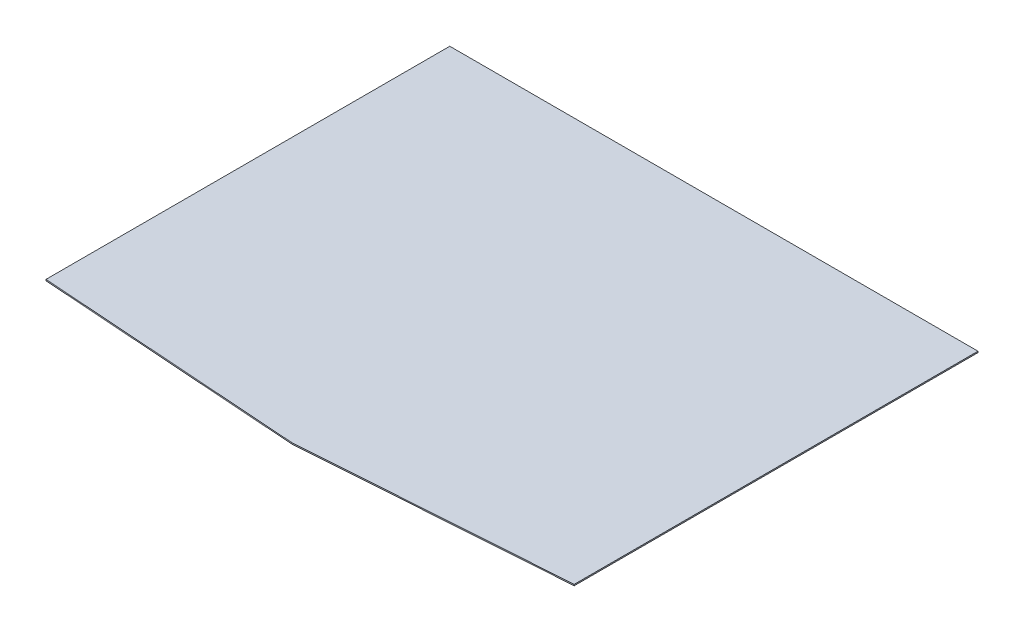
ISO-10303-21;
HEADER;
FILE_DESCRIPTION(('STEP AP214'),'2;1');
FILE_NAME('part.step','',(''),(''),'','','');
FILE_SCHEMA(('AUTOMOTIVE_DESIGN { 1 0 10303 214 1 1 1 1 }'));
ENDSEC;
DATA;
#1=APPLICATION_CONTEXT('core data for automotive mechanical design processes');
#2=APPLICATION_PROTOCOL_DEFINITION('international standard','automotive_design',2000,#1);
#3=PRODUCT_CONTEXT('',#1,'mechanical');
#4=PRODUCT('Part','Part','',(#3));
#5=PRODUCT_RELATED_PRODUCT_CATEGORY('part','',(#4));
#6=PRODUCT_DEFINITION_FORMATION('','',#4);
#7=PRODUCT_DEFINITION_CONTEXT('part definition',#1,'design');
#8=PRODUCT_DEFINITION('design','',#6,#7);
#9=PRODUCT_DEFINITION_SHAPE('','',#8);
#10=(LENGTH_UNIT() NAMED_UNIT(*) SI_UNIT(.MILLI.,.METRE.));
#11=(NAMED_UNIT(*) PLANE_ANGLE_UNIT() SI_UNIT($,.RADIAN.));
#12=(NAMED_UNIT(*) SI_UNIT($,.STERADIAN.) SOLID_ANGLE_UNIT());
#13=UNCERTAINTY_MEASURE_WITH_UNIT(LENGTH_MEASURE(1.E-05),#10,'distance_accuracy_value','');
#14=(GEOMETRIC_REPRESENTATION_CONTEXT(3) GLOBAL_UNCERTAINTY_ASSIGNED_CONTEXT((#13)) GLOBAL_UNIT_ASSIGNED_CONTEXT((#10,
#11,#12)) REPRESENTATION_CONTEXT('',''));
#15=CARTESIAN_POINT('',(0.,0.,0.));
#16=DIRECTION('',(0.,0.,1.));
#17=DIRECTION('',(1.,0.,0.));
#18=AXIS2_PLACEMENT_3D('',#15,#16,#17);
#19=CARTESIAN_POINT('',(-996.95,-4.7625,-69.7135351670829));
#20=DIRECTION('',(-0.0697564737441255,0.,0.997564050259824));
#21=DIRECTION('',(0.997564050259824,0.,0.0697564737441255));
#22=AXIS2_PLACEMENT_3D('',#19,#20,#21);
#23=PLANE('',#22);
#24=DIRECTION('',(0.997564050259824,0.,0.0697564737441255));
#25=VECTOR('',#24,1.);
#26=CARTESIAN_POINT('',(-996.95,0.,-69.7135351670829));
#27=LINE('',#26,#25);
#28=CARTESIAN_POINT('',(-996.95,0.,-69.7135351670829));
#29=VERTEX_POINT('',#28);
#30=CARTESIAN_POINT('',(0.,0.,0.));
#31=VERTEX_POINT('',#30);
#32=EDGE_CURVE('E114',#29,#31,#27,.T.);
#33=ORIENTED_EDGE('',*,*,#32,.F.);
#34=DIRECTION('',(0.,1.,0.));
#35=VECTOR('',#34,1.);
#36=CARTESIAN_POINT('',(-996.95,-4.7625,-69.7135351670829));
#37=LINE('',#36,#35);
#38=CARTESIAN_POINT('',(-996.95,-4.7625,-69.7135351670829));
#39=VERTEX_POINT('',#38);
#40=EDGE_CURVE('E11',#39,#29,#37,.T.);
#41=ORIENTED_EDGE('',*,*,#40,.F.);
#42=DIRECTION('',(0.997564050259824,0.,0.0697564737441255));
#43=VECTOR('',#42,1.);
#44=CARTESIAN_POINT('',(-996.95,-4.7625,-69.7135351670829));
#45=LINE('',#44,#43);
#46=CARTESIAN_POINT('',(0.,-4.7625,0.));
#47=VERTEX_POINT('',#46);
#48=EDGE_CURVE('E109',#39,#47,#45,.T.);
#49=ORIENTED_EDGE('',*,*,#48,.T.);
#50=DIRECTION('',(0.,1.,0.));
#51=VECTOR('',#50,1.);
#52=CARTESIAN_POINT('',(0.,-4.7625,0.));
#53=LINE('',#52,#51);
#54=EDGE_CURVE('E40',#47,#31,#53,.T.);
#55=ORIENTED_EDGE('',*,*,#54,.T.);
#56=EDGE_LOOP('',(#33,#41,#49,#55));
#57=FACE_BOUND('',#56,.T.);
#58=ADVANCED_FACE('F37',(#57),#23,.T.);
#59=CARTESIAN_POINT('',(-996.95,-4.7625,-1593.85));
#60=DIRECTION('',(-1.,0.,0.));
#61=DIRECTION('',(0.,0.,1.));
#62=AXIS2_PLACEMENT_3D('',#59,#60,#61);
#63=PLANE('',#62);
#64=DIRECTION('',(0.,0.,1.));
#65=VECTOR('',#64,1.);
#66=CARTESIAN_POINT('',(-996.95,0.,-1593.85));
#67=LINE('',#66,#65);
#68=CARTESIAN_POINT('',(-996.95,0.,-1593.85));
#69=VERTEX_POINT('',#68);
#70=EDGE_CURVE('E123',#69,#29,#67,.T.);
#71=ORIENTED_EDGE('',*,*,#70,.F.);
#72=DIRECTION('',(0.,1.,0.));
#73=VECTOR('',#72,1.);
#74=CARTESIAN_POINT('',(-996.95,-4.7625,-1593.85));
#75=LINE('',#74,#73);
#76=CARTESIAN_POINT('',(-996.95,-4.7625,-1593.85));
#77=VERTEX_POINT('',#76);
#78=EDGE_CURVE('E46',#77,#69,#75,.T.);
#79=ORIENTED_EDGE('',*,*,#78,.F.);
#80=DIRECTION('',(0.,0.,1.));
#81=VECTOR('',#80,1.);
#82=CARTESIAN_POINT('',(-996.95,-4.7625,-1593.85));
#83=LINE('',#82,#81);
#84=EDGE_CURVE('E104',#77,#39,#83,.T.);
#85=ORIENTED_EDGE('',*,*,#84,.T.);
#86=ORIENTED_EDGE('',*,*,#40,.T.);
#87=EDGE_LOOP('',(#71,#79,#85,#86));
#88=FACE_BOUND('',#87,.T.);
#89=ADVANCED_FACE('F129',(#88),#63,.T.);
#90=CARTESIAN_POINT('',(996.95,-4.7625,-1593.85));
#91=DIRECTION('',(0.,0.,-1.));
#92=DIRECTION('',(-1.,0.,0.));
#93=AXIS2_PLACEMENT_3D('',#90,#91,#92);
#94=PLANE('',#93);
#95=DIRECTION('',(-1.,0.,0.));
#96=VECTOR('',#95,1.);
#97=CARTESIAN_POINT('',(996.95,0.,-1593.85));
#98=LINE('',#97,#96);
#99=CARTESIAN_POINT('',(996.95,0.,-1593.85));
#100=VERTEX_POINT('',#99);
#101=EDGE_CURVE('E93',#100,#69,#98,.T.);
#102=ORIENTED_EDGE('',*,*,#101,.F.);
#103=DIRECTION('',(0.,1.,0.));
#104=VECTOR('',#103,1.);
#105=CARTESIAN_POINT('',(996.95,-4.7625,-1593.85));
#106=LINE('',#105,#104);
#107=CARTESIAN_POINT('',(996.95,-4.7625,-1593.85));
#108=VERTEX_POINT('',#107);
#109=EDGE_CURVE('E88',#108,#100,#106,.T.);
#110=ORIENTED_EDGE('',*,*,#109,.F.);
#111=DIRECTION('',(-1.,0.,0.));
#112=VECTOR('',#111,1.);
#113=CARTESIAN_POINT('',(996.95,-4.7625,-1593.85));
#114=LINE('',#113,#112);
#115=EDGE_CURVE('E91',#108,#77,#114,.T.);
#116=ORIENTED_EDGE('',*,*,#115,.T.);
#117=ORIENTED_EDGE('',*,*,#78,.T.);
#118=EDGE_LOOP('',(#102,#110,#116,#117));
#119=FACE_BOUND('',#118,.T.);
#120=ADVANCED_FACE('F90',(#119),#94,.T.);
#121=CARTESIAN_POINT('',(996.95,-4.7625,-69.713535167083));
#122=DIRECTION('',(1.,0.,0.));
#123=DIRECTION('',(0.,0.,-1.));
#124=AXIS2_PLACEMENT_3D('',#121,#122,#123);
#125=PLANE('',#124);
#126=DIRECTION('',(0.,0.,-1.));
#127=VECTOR('',#126,1.);
#128=CARTESIAN_POINT('',(996.95,0.,-69.713535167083));
#129=LINE('',#128,#127);
#130=CARTESIAN_POINT('',(996.95,0.,-69.713535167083));
#131=VERTEX_POINT('',#130);
#132=EDGE_CURVE('E120',#131,#100,#129,.T.);
#133=ORIENTED_EDGE('',*,*,#132,.F.);
#134=DIRECTION('',(0.,1.,0.));
#135=VECTOR('',#134,1.);
#136=CARTESIAN_POINT('',(996.95,-4.7625,-69.713535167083));
#137=LINE('',#136,#135);
#138=CARTESIAN_POINT('',(996.95,-4.7625,-69.713535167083));
#139=VERTEX_POINT('',#138);
#140=EDGE_CURVE('E98',#139,#131,#137,.T.);
#141=ORIENTED_EDGE('',*,*,#140,.F.);
#142=DIRECTION('',(0.,0.,-1.));
#143=VECTOR('',#142,1.);
#144=CARTESIAN_POINT('',(996.95,-4.7625,-69.713535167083));
#145=LINE('',#144,#143);
#146=EDGE_CURVE('E103',#139,#108,#145,.T.);
#147=ORIENTED_EDGE('',*,*,#146,.T.);
#148=ORIENTED_EDGE('',*,*,#109,.T.);
#149=EDGE_LOOP('',(#133,#141,#147,#148));
#150=FACE_BOUND('',#149,.T.);
#151=ADVANCED_FACE('F106',(#150),#125,.T.);
#152=CARTESIAN_POINT('',(0.,-4.7625,0.));
#153=DIRECTION('',(0.0697564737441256,0.,0.997564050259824));
#154=DIRECTION('',(0.997564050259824,0.,-0.0697564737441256));
#155=AXIS2_PLACEMENT_3D('',#152,#153,#154);
#156=PLANE('',#155);
#157=DIRECTION('',(0.997564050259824,0.,-0.0697564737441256));
#158=VECTOR('',#157,1.);
#159=CARTESIAN_POINT('',(0.,0.,0.));
#160=LINE('',#159,#158);
#161=EDGE_CURVE('E117',#31,#131,#160,.T.);
#162=ORIENTED_EDGE('',*,*,#161,.F.);
#163=ORIENTED_EDGE('',*,*,#54,.F.);
#164=DIRECTION('',(0.997564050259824,0.,-0.0697564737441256));
#165=VECTOR('',#164,1.);
#166=CARTESIAN_POINT('',(0.,-4.7625,0.));
#167=LINE('',#166,#165);
#168=EDGE_CURVE('E107',#47,#139,#167,.T.);
#169=ORIENTED_EDGE('',*,*,#168,.T.);
#170=ORIENTED_EDGE('',*,*,#140,.T.);
#171=EDGE_LOOP('',(#162,#163,#169,#170));
#172=FACE_BOUND('',#171,.T.);
#173=ADVANCED_FACE('F126',(#172),#156,.T.);
#174=CARTESIAN_POINT('',(996.95,-4.7625,69.7135351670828));
#175=DIRECTION('',(0.,1.,0.));
#176=DIRECTION('',(0.,0.,1.));
#177=AXIS2_PLACEMENT_3D('',#174,#175,#176);
#178=PLANE('',#177);
#179=ORIENTED_EDGE('',*,*,#48,.F.);
#180=ORIENTED_EDGE('',*,*,#84,.F.);
#181=ORIENTED_EDGE('',*,*,#115,.F.);
#182=ORIENTED_EDGE('',*,*,#146,.F.);
#183=ORIENTED_EDGE('',*,*,#168,.F.);
#184=EDGE_LOOP('',(#179,#180,#181,#182,#183));
#185=FACE_BOUND('',#184,.T.);
#186=ADVANCED_FACE('F102',(#185),#178,.F.);
#187=CARTESIAN_POINT('',(996.95,0.,69.7135351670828));
#188=DIRECTION('',(0.,1.,0.));
#189=DIRECTION('',(0.,0.,1.));
#190=AXIS2_PLACEMENT_3D('',#187,#188,#189);
#191=PLANE('',#190);
#192=ORIENTED_EDGE('',*,*,#32,.T.);
#193=ORIENTED_EDGE('',*,*,#161,.T.);
#194=ORIENTED_EDGE('',*,*,#132,.T.);
#195=ORIENTED_EDGE('',*,*,#101,.T.);
#196=ORIENTED_EDGE('',*,*,#70,.T.);
#197=EDGE_LOOP('',(#192,#193,#194,#195,#196));
#198=FACE_BOUND('',#197,.T.);
#199=ADVANCED_FACE('F128',(#198),#191,.T.);
#200=CLOSED_SHELL('',(#58,#89,#120,#151,#173,#186,#199));
#201=MANIFOLD_SOLID_BREP('B2',#200);
#202=ADVANCED_BREP_SHAPE_REPRESENTATION('',(#18,#201),#14);
#203=SHAPE_DEFINITION_REPRESENTATION(#9,#202);
ENDSEC;
END-ISO-10303-21;
